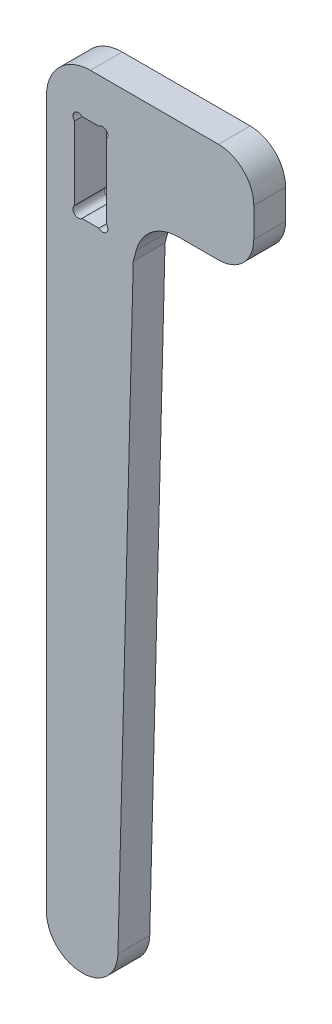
from build123d import *

# Parameters (mm, degrees)
BOSS_EXTRU_1_DEPTH      = 18
CONG_1_R                = 20
CONG_2_R                = 20
ESQUISSE2_W             = 18
ESQUISSE2_H             = 50
ENL_V_MAT_EXTRU_1_DEPTH = 413.372550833
ESQUISSE3_R             = 3
ENL_V_MAT_EXTRU_2_DEPTH = 413.372550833


with BuildPart() as part:
    # Esquisse1 → Boss.-Extru.1 (new body)
    with BuildSketch(Plane.XY):
        with BuildLine():
            Line((74.9, -6.75419933), (117.39297543, -6.75419933))
            Line((117.39297543, -6.75419933), (117.39297543, 50))
            Line((117.39297543, 50), (24.9, 50))
            ThreePointArc((24.9, 50), (7.293041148, 42.706958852), (0, 25.1))
            Line((0, 25.1), (0, -394.9))
            Line((0, -394.9), (40, -394.9))
            Line((40, -394.9), (49.152085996, -31.542605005))
            Line((49.152085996, -31.542605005), (50.847914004, -25.211594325))
            ThreePointArc((50.847914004, -25.211594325), (59.741023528, -11.900328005), (74.9, -6.75419933))
        make_face()
    extrude(amount=BOSS_EXTRU_1_DEPTH)

    # Cong_1
    cong_1_edges = [part.edges().sort_by_distance(p)[0] for p in [
        (117.39297543, 50, 9),
        (117.39297543, -6.75419933, 9),
    ]]
    fillet(cong_1_edges, radius=CONG_1_R)

    # Cong_2
    cong_2_edges = [part.edges().sort_by_distance(p)[0] for p in [
        (40, -394.9, 9),
        (0, -394.9, 9),
    ]]
    fillet(cong_2_edges, radius=CONG_2_R)

    # Esquisse2 → Enl_v. mat.-Extru.1 (cut, through all)
    with BuildSketch(Plane.XY.offset(18)):
        with Locations((24.9, 0)):
            Rectangle(ESQUISSE2_W, ESQUISSE2_H)
    extrude(amount=-ENL_V_MAT_EXTRU_1_DEPTH, mode=Mode.SUBTRACT)

    # Esquisse3 → Enl_v. mat.-Extru.2 (cut, through all)
    with BuildSketch(Plane.XY.offset(18)):
        with Locations((18.021320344, 22.878679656)):
            Circle(ESQUISSE3_R)
        with Locations((31.778679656, -22.878679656)):
            Circle(ESQUISSE3_R)
        with Locations((31.778679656, 22.878679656)):
            Circle(ESQUISSE3_R)
        with Locations((18.021320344, -22.878679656)):
            Circle(ESQUISSE3_R)
    extrude(amount=-ENL_V_MAT_EXTRU_2_DEPTH, mode=Mode.SUBTRACT)


solid = part.part
